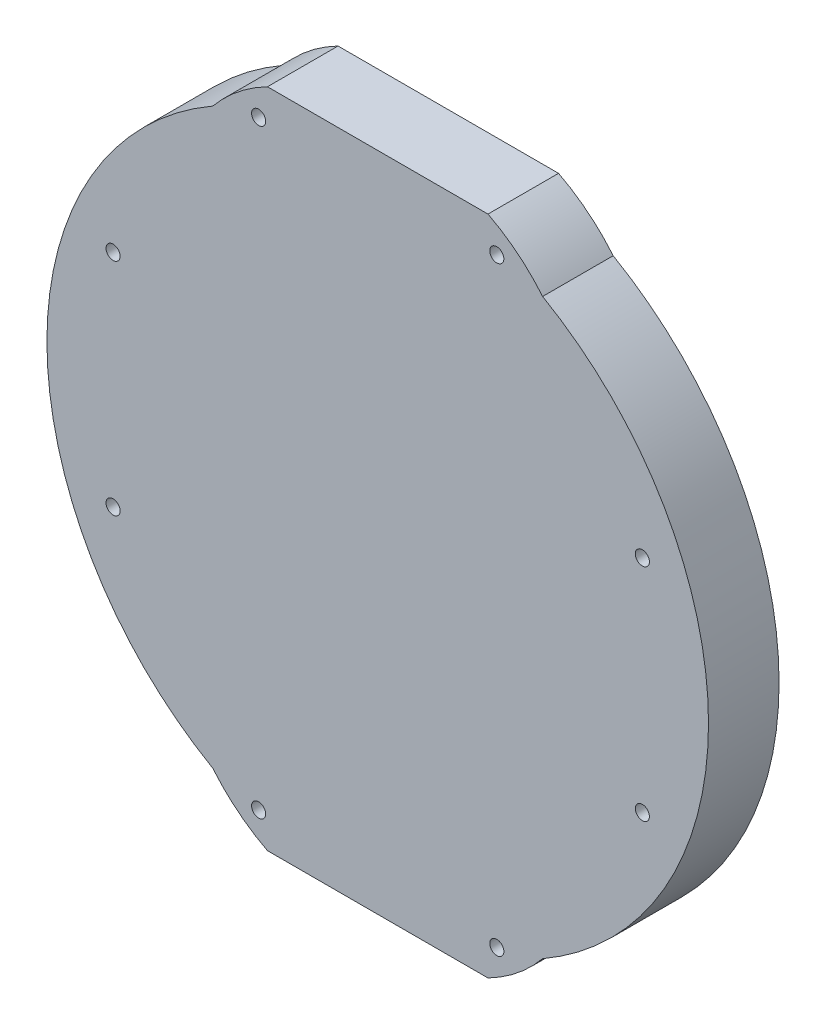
from build123d import *

# Parameters (mm, degrees)
SKETCH_1_R      = 1.6
EXTRUDE_1_DEPTH = 16


with BuildPart() as part:
    # Sketch 1 → Extrude 1 (new body)
    with BuildSketch(Plane.XY):
        with BuildLine():
            ThreePointArc((-37.391076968, -65.014670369), (-31.70291567, -70.636953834), (-25, -75))
            Line((-25, -75), (25, -75))
            ThreePointArc((25, -75), (31.70291567, -70.636953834), (37.391076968, -65.014670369))
            ThreePointArc((37.391076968, -65.014670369), (75, 0), (37.391076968, 65.014670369))
            ThreePointArc((37.391076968, 65.014670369), (31.70291567, 70.636953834), (25, 75))
            Line((25, 75), (-25, 75))
            ThreePointArc((-25, 75), (-31.70291567, 70.636953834), (-37.391076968, 65.014670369))
            ThreePointArc((-37.391076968, 65.014670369), (-75, 0), (-37.391076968, -65.014670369))
        make_face()
        with Locations((27, 68)):
            Circle(SKETCH_1_R, mode=Mode.SUBTRACT)
        with Locations((-27, -68)):
            Circle(SKETCH_1_R, mode=Mode.SUBTRACT)
        with Locations((-60, -25)):
            Circle(SKETCH_1_R, mode=Mode.SUBTRACT)
        with Locations((27, -68)):
            Circle(SKETCH_1_R, mode=Mode.SUBTRACT)
        with Locations((60, -25)):
            Circle(SKETCH_1_R, mode=Mode.SUBTRACT)
        with Locations((-60, 25)):
            Circle(SKETCH_1_R, mode=Mode.SUBTRACT)
        with Locations((-27, 68)):
            Circle(SKETCH_1_R, mode=Mode.SUBTRACT)
        with Locations((60, 25)):
            Circle(SKETCH_1_R, mode=Mode.SUBTRACT)
    extrude(amount=EXTRUDE_1_DEPTH)


solid = part.part
